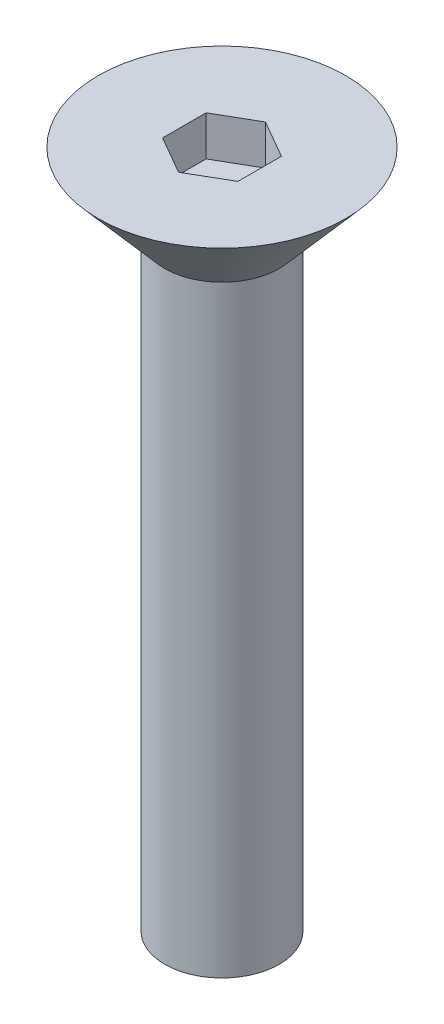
ISO-10303-21;
HEADER;
FILE_DESCRIPTION(('STEP AP214'),'2;1');
FILE_NAME('part.step','',(''),(''),'','','');
FILE_SCHEMA(('AUTOMOTIVE_DESIGN { 1 0 10303 214 1 1 1 1 }'));
ENDSEC;
DATA;
#1=APPLICATION_CONTEXT('core data for automotive mechanical design processes');
#2=APPLICATION_PROTOCOL_DEFINITION('international standard','automotive_design',2000,#1);
#3=PRODUCT_CONTEXT('',#1,'mechanical');
#4=PRODUCT('Part','Part','',(#3));
#5=PRODUCT_RELATED_PRODUCT_CATEGORY('part','',(#4));
#6=PRODUCT_DEFINITION_FORMATION('','',#4);
#7=PRODUCT_DEFINITION_CONTEXT('part definition',#1,'design');
#8=PRODUCT_DEFINITION('design','',#6,#7);
#9=PRODUCT_DEFINITION_SHAPE('','',#8);
#10=(LENGTH_UNIT() NAMED_UNIT(*) SI_UNIT(.MILLI.,.METRE.));
#11=(NAMED_UNIT(*) PLANE_ANGLE_UNIT() SI_UNIT($,.RADIAN.));
#12=(NAMED_UNIT(*) SI_UNIT($,.STERADIAN.) SOLID_ANGLE_UNIT());
#13=UNCERTAINTY_MEASURE_WITH_UNIT(LENGTH_MEASURE(1.E-05),#10,'distance_accuracy_value','');
#14=(GEOMETRIC_REPRESENTATION_CONTEXT(3) GLOBAL_UNCERTAINTY_ASSIGNED_CONTEXT((#13)) GLOBAL_UNIT_ASSIGNED_CONTEXT((#10,
#11,#12)) REPRESENTATION_CONTEXT('',''));
#15=CARTESIAN_POINT('',(0.,0.,0.));
#16=DIRECTION('',(0.,0.,1.));
#17=DIRECTION('',(1.,0.,0.));
#18=AXIS2_PLACEMENT_3D('',#15,#16,#17);
#19=CARTESIAN_POINT('',(2.41300000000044,-28.6287390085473,4.44089209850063E-13));
#20=DIRECTION('',(0.,-1.,0.));
#21=DIRECTION('',(0.,0.,-1.));
#22=AXIS2_PLACEMENT_3D('',#19,#20,#21);
#23=PLANE('',#22);
#24=CARTESIAN_POINT('',(8.88178419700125E-13,-28.6287390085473,2.22044604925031E-13));
#25=DIRECTION('',(0.,1.,0.));
#26=DIRECTION('',(0.,0.,1.));
#27=AXIS2_PLACEMENT_3D('',#24,#25,#26);
#28=CIRCLE('',#27,2.41300000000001);
#29=CARTESIAN_POINT('',(8.88312368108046E-13,-28.6287390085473,2.41300000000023));
#30=VERTEX_POINT('',#29);
#31=EDGE_CURVE('E11',#30,#30,#28,.T.);
#32=ORIENTED_EDGE('',*,*,#31,.F.);
#33=EDGE_LOOP('',(#32));
#34=FACE_BOUND('',#33,.T.);
#35=ADVANCED_FACE('F30',(#34),#23,.T.);
#36=CARTESIAN_POINT('',(2.22044604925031E-13,25.4,4.44089209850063E-13));
#37=DIRECTION('',(0.,1.,0.));
#38=DIRECTION('',(0.,0.,1.));
#39=AXIS2_PLACEMENT_3D('',#36,#37,#38);
#40=CYLINDRICAL_SURFACE('',#39,2.413);
#41=ORIENTED_EDGE('',*,*,#31,.T.);
#42=EDGE_LOOP('',(#41));
#43=FACE_BOUND('',#42,.T.);
#44=CARTESIAN_POINT('',(4.44089209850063E-13,-3.22873900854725,0.));
#45=DIRECTION('',(0.,1.,0.));
#46=DIRECTION('',(0.,0.,1.));
#47=AXIS2_PLACEMENT_3D('',#44,#45,#46);
#48=CIRCLE('',#47,2.413);
#49=CARTESIAN_POINT('',(4.44223158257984E-13,-3.22873900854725,2.413));
#50=VERTEX_POINT('',#49);
#51=EDGE_CURVE('E37',#50,#50,#48,.T.);
#52=ORIENTED_EDGE('',*,*,#51,.F.);
#53=EDGE_LOOP('',(#52));
#54=FACE_BOUND('',#53,.T.);
#55=ADVANCED_FACE('F143',(#43,#54),#40,.T.);
#56=CARTESIAN_POINT('',(4.44089209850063E-13,-3.22873900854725,0.));
#57=DIRECTION('',(0.,1.,0.));
#58=DIRECTION('',(0.,0.,1.));
#59=AXIS2_PLACEMENT_3D('',#56,#57,#58);
#60=CONICAL_SURFACE('',#59,2.413,0.715584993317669);
#61=CARTESIAN_POINT('',(0.,0.,0.));
#62=DIRECTION('',(0.,1.,0.));
#63=DIRECTION('',(0.,0.,1.));
#64=AXIS2_PLACEMENT_3D('',#61,#62,#63);
#65=CIRCLE('',#64,5.2197);
#66=CARTESIAN_POINT('',(0.,0.,5.2197));
#67=VERTEX_POINT('',#66);
#68=EDGE_CURVE('E130',#67,#67,#65,.T.);
#69=ORIENTED_EDGE('',*,*,#68,.F.);
#70=EDGE_LOOP('',(#69));
#71=FACE_BOUND('',#70,.T.);
#72=ORIENTED_EDGE('',*,*,#51,.T.);
#73=EDGE_LOOP('',(#72));
#74=FACE_BOUND('',#73,.T.);
#75=ADVANCED_FACE('F141',(#71,#74),#60,.T.);
#76=CARTESIAN_POINT('',(0.,0.,0.));
#77=DIRECTION('',(0.,1.,0.));
#78=DIRECTION('',(0.,0.,1.));
#79=AXIS2_PLACEMENT_3D('',#76,#77,#78);
#80=PLANE('',#79);
#81=DIRECTION('',(0.,0.,1.));
#82=VECTOR('',#81,1.);
#83=CARTESIAN_POINT('',(-1.58749999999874,0.,-0.916543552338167));
#84=LINE('',#83,#82);
#85=CARTESIAN_POINT('',(-1.58749999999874,0.,-0.916543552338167));
#86=VERTEX_POINT('',#85);
#87=CARTESIAN_POINT('',(-1.58749999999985,0.,0.916543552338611));
#88=VERTEX_POINT('',#87);
#89=EDGE_CURVE('E44',#86,#88,#84,.T.);
#90=ORIENTED_EDGE('',*,*,#89,.F.);
#91=DIRECTION('',(-0.866025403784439,0.,0.5));
#92=VECTOR('',#91,1.);
#93=CARTESIAN_POINT('',(6.66133814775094E-13,0.,-1.83308710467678));
#94=LINE('',#93,#92);
#95=CARTESIAN_POINT('',(6.66133814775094E-13,0.,-1.83308710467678));
#96=VERTEX_POINT('',#95);
#97=EDGE_CURVE('E114',#96,#86,#94,.T.);
#98=ORIENTED_EDGE('',*,*,#97,.F.);
#99=DIRECTION('',(0.866025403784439,0.,0.5));
#100=VECTOR('',#99,1.);
#101=CARTESIAN_POINT('',(6.66133814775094E-13,0.,-1.83308710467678));
#102=LINE('',#101,#100);
#103=CARTESIAN_POINT('',(1.58750000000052,0.,-0.916543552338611));
#104=VERTEX_POINT('',#103);
#105=EDGE_CURVE('E109',#96,#104,#102,.T.);
#106=ORIENTED_EDGE('',*,*,#105,.T.);
#107=DIRECTION('',(0.,0.,1.));
#108=VECTOR('',#107,1.);
#109=CARTESIAN_POINT('',(1.58750000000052,0.,-0.916543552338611));
#110=LINE('',#109,#108);
#111=CARTESIAN_POINT('',(1.58750000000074,0.,0.916543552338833));
#112=VERTEX_POINT('',#111);
#113=EDGE_CURVE('E107',#104,#112,#110,.T.);
#114=ORIENTED_EDGE('',*,*,#113,.T.);
#115=DIRECTION('',(0.866025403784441,0.,-0.499999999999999));
#116=VECTOR('',#115,1.);
#117=CARTESIAN_POINT('',(6.66133814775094E-13,0.,1.83308710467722));
#118=LINE('',#117,#116);
#119=CARTESIAN_POINT('',(6.66133814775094E-13,0.,1.83308710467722));
#120=VERTEX_POINT('',#119);
#121=EDGE_CURVE('E89',#120,#112,#118,.T.);
#122=ORIENTED_EDGE('',*,*,#121,.F.);
#123=DIRECTION('',(-0.866025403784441,0.,-0.499999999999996));
#124=VECTOR('',#123,1.);
#125=CARTESIAN_POINT('',(6.66133814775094E-13,0.,1.83308710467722));
#126=LINE('',#125,#124);
#127=EDGE_CURVE('E99',#120,#88,#126,.T.);
#128=ORIENTED_EDGE('',*,*,#127,.T.);
#129=EDGE_LOOP('',(#90,#98,#106,#114,#122,#128));
#130=FACE_BOUND('',#129,.T.);
#131=ORIENTED_EDGE('',*,*,#68,.T.);
#132=EDGE_LOOP('',(#131));
#133=FACE_BOUND('',#132,.T.);
#134=ADVANCED_FACE('F103',(#130,#133),#80,.T.);
#135=CARTESIAN_POINT('',(-1.58749999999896,-1.68402000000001,-0.916543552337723));
#136=DIRECTION('',(-1.,0.,0.));
#137=DIRECTION('',(0.,0.,1.));
#138=AXIS2_PLACEMENT_3D('',#135,#136,#137);
#139=PLANE('',#138);
#140=ORIENTED_EDGE('',*,*,#89,.T.);
#141=DIRECTION('',(0.,1.,0.));
#142=VECTOR('',#141,1.);
#143=CARTESIAN_POINT('',(-1.58749999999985,-1.68401999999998,0.916543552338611));
#144=LINE('',#143,#142);
#145=CARTESIAN_POINT('',(-1.58749999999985,-1.68401999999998,0.916543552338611));
#146=VERTEX_POINT('',#145);
#147=EDGE_CURVE('E96',#146,#88,#144,.T.);
#148=ORIENTED_EDGE('',*,*,#147,.F.);
#149=DIRECTION('',(0.,0.,1.));
#150=VECTOR('',#149,1.);
#151=CARTESIAN_POINT('',(-1.58749999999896,-1.68402000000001,-0.916543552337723));
#152=LINE('',#151,#150);
#153=CARTESIAN_POINT('',(-1.58749999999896,-1.68402000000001,-0.916543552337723));
#154=VERTEX_POINT('',#153);
#155=EDGE_CURVE('E116',#154,#146,#152,.T.);
#156=ORIENTED_EDGE('',*,*,#155,.F.);
#157=DIRECTION('',(0.,1.,0.));
#158=VECTOR('',#157,1.);
#159=CARTESIAN_POINT('',(-1.58749999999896,-1.68402000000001,-0.916543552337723));
#160=LINE('',#159,#158);
#161=EDGE_CURVE('E51',#154,#86,#160,.T.);
#162=ORIENTED_EDGE('',*,*,#161,.T.);
#163=EDGE_LOOP('',(#140,#148,#156,#162));
#164=FACE_BOUND('',#163,.T.);
#165=ADVANCED_FACE('F156',(#164),#139,.F.);
#166=CARTESIAN_POINT('',(4.44089209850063E-13,-1.68402000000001,-1.833087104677));
#167=DIRECTION('',(-0.5,0.,-0.866025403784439));
#168=DIRECTION('',(-0.866025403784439,0.,0.5));
#169=AXIS2_PLACEMENT_3D('',#166,#167,#168);
#170=PLANE('',#169);
#171=ORIENTED_EDGE('',*,*,#97,.T.);
#172=ORIENTED_EDGE('',*,*,#161,.F.);
#173=DIRECTION('',(-0.866025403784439,0.,0.5));
#174=VECTOR('',#173,1.);
#175=CARTESIAN_POINT('',(4.44089209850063E-13,-1.68402000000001,-1.833087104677));
#176=LINE('',#175,#174);
#177=CARTESIAN_POINT('',(4.44089209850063E-13,-1.68402000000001,-1.833087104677));
#178=VERTEX_POINT('',#177);
#179=EDGE_CURVE('E126',#178,#154,#176,.T.);
#180=ORIENTED_EDGE('',*,*,#179,.F.);
#181=DIRECTION('',(0.,1.,0.));
#182=VECTOR('',#181,1.);
#183=CARTESIAN_POINT('',(4.44089209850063E-13,-1.68402000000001,-1.833087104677));
#184=LINE('',#183,#182);
#185=EDGE_CURVE('E131',#178,#96,#184,.T.);
#186=ORIENTED_EDGE('',*,*,#185,.T.);
#187=EDGE_LOOP('',(#171,#172,#180,#186));
#188=FACE_BOUND('',#187,.T.);
#189=ADVANCED_FACE('F159',(#188),#170,.F.);
#190=CARTESIAN_POINT('',(4.44089209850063E-13,-1.68402000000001,-1.833087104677));
#191=DIRECTION('',(-0.5,0.,0.866025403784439));
#192=DIRECTION('',(0.866025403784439,0.,0.5));
#193=AXIS2_PLACEMENT_3D('',#190,#191,#192);
#194=PLANE('',#193);
#195=ORIENTED_EDGE('',*,*,#105,.F.);
#196=ORIENTED_EDGE('',*,*,#185,.F.);
#197=DIRECTION('',(0.866025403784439,0.,0.5));
#198=VECTOR('',#197,1.);
#199=CARTESIAN_POINT('',(4.44089209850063E-13,-1.68402000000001,-1.833087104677));
#200=LINE('',#199,#198);
#201=CARTESIAN_POINT('',(1.58750000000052,-1.68402000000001,-0.916543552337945));
#202=VERTEX_POINT('',#201);
#203=EDGE_CURVE('E124',#178,#202,#200,.T.);
#204=ORIENTED_EDGE('',*,*,#203,.T.);
#205=DIRECTION('',(0.,1.,0.));
#206=VECTOR('',#205,1.);
#207=CARTESIAN_POINT('',(1.58750000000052,-1.68402000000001,-0.916543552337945));
#208=LINE('',#207,#206);
#209=EDGE_CURVE('E133',#202,#104,#208,.T.);
#210=ORIENTED_EDGE('',*,*,#209,.T.);
#211=EDGE_LOOP('',(#195,#196,#204,#210));
#212=FACE_BOUND('',#211,.T.);
#213=ADVANCED_FACE('F168',(#212),#194,.T.);
#214=CARTESIAN_POINT('',(1.58750000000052,-1.68402000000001,-0.916543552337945));
#215=DIRECTION('',(-1.,0.,0.));
#216=DIRECTION('',(0.,0.,1.));
#217=AXIS2_PLACEMENT_3D('',#214,#215,#216);
#218=PLANE('',#217);
#219=ORIENTED_EDGE('',*,*,#113,.F.);
#220=ORIENTED_EDGE('',*,*,#209,.F.);
#221=DIRECTION('',(0.,0.,1.));
#222=VECTOR('',#221,1.);
#223=CARTESIAN_POINT('',(1.58750000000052,-1.68402000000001,-0.916543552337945));
#224=LINE('',#223,#222);
#225=CARTESIAN_POINT('',(1.58750000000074,-1.68402000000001,0.916543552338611));
#226=VERTEX_POINT('',#225);
#227=EDGE_CURVE('E122',#202,#226,#224,.T.);
#228=ORIENTED_EDGE('',*,*,#227,.T.);
#229=DIRECTION('',(0.,1.,0.));
#230=VECTOR('',#229,1.);
#231=CARTESIAN_POINT('',(1.58750000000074,-1.68402000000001,0.916543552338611));
#232=LINE('',#231,#230);
#233=EDGE_CURVE('E95',#226,#112,#232,.T.);
#234=ORIENTED_EDGE('',*,*,#233,.T.);
#235=EDGE_LOOP('',(#219,#220,#228,#234));
#236=FACE_BOUND('',#235,.T.);
#237=ADVANCED_FACE('F165',(#236),#218,.T.);
#238=CARTESIAN_POINT('',(6.66133814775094E-13,-1.68401999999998,1.83308710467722));
#239=DIRECTION('',(0.499999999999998,0.,0.86602540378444));
#240=DIRECTION('',(0.866025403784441,0.,-0.499999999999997));
#241=AXIS2_PLACEMENT_3D('',#238,#239,#240);
#242=PLANE('',#241);
#243=ORIENTED_EDGE('',*,*,#121,.T.);
#244=ORIENTED_EDGE('',*,*,#233,.F.);
#245=DIRECTION('',(0.866025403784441,0.,-0.499999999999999));
#246=VECTOR('',#245,1.);
#247=CARTESIAN_POINT('',(6.66133814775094E-13,-1.68401999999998,1.83308710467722));
#248=LINE('',#247,#246);
#249=CARTESIAN_POINT('',(6.66133814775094E-13,-1.68401999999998,1.83308710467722));
#250=VERTEX_POINT('',#249);
#251=EDGE_CURVE('E92',#250,#226,#248,.T.);
#252=ORIENTED_EDGE('',*,*,#251,.F.);
#253=DIRECTION('',(0.,1.,0.));
#254=VECTOR('',#253,1.);
#255=CARTESIAN_POINT('',(6.66133814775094E-13,-1.68401999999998,1.83308710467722));
#256=LINE('',#255,#254);
#257=EDGE_CURVE('E84',#250,#120,#256,.T.);
#258=ORIENTED_EDGE('',*,*,#257,.T.);
#259=EDGE_LOOP('',(#243,#244,#252,#258));
#260=FACE_BOUND('',#259,.T.);
#261=ADVANCED_FACE('F86',(#260),#242,.F.);
#262=CARTESIAN_POINT('',(6.66133814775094E-13,-1.68401999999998,1.83308710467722));
#263=DIRECTION('',(0.499999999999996,0.,-0.866025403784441));
#264=DIRECTION('',(-0.866025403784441,0.,-0.499999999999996));
#265=AXIS2_PLACEMENT_3D('',#262,#263,#264);
#266=PLANE('',#265);
#267=ORIENTED_EDGE('',*,*,#127,.F.);
#268=ORIENTED_EDGE('',*,*,#257,.F.);
#269=DIRECTION('',(-0.866025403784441,0.,-0.499999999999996));
#270=VECTOR('',#269,1.);
#271=CARTESIAN_POINT('',(6.66133814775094E-13,-1.68401999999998,1.83308710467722));
#272=LINE('',#271,#270);
#273=EDGE_CURVE('E119',#250,#146,#272,.T.);
#274=ORIENTED_EDGE('',*,*,#273,.T.);
#275=ORIENTED_EDGE('',*,*,#147,.T.);
#276=EDGE_LOOP('',(#267,#268,#274,#275));
#277=FACE_BOUND('',#276,.T.);
#278=ADVANCED_FACE('F100',(#277),#266,.T.);
#279=CARTESIAN_POINT('',(-1.58749999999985,-1.68401999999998,0.916543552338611));
#280=DIRECTION('',(0.,-1.,0.));
#281=DIRECTION('',(0.,0.,-1.));
#282=AXIS2_PLACEMENT_3D('',#279,#280,#281);
#283=PLANE('',#282);
#284=ORIENTED_EDGE('',*,*,#155,.T.);
#285=ORIENTED_EDGE('',*,*,#273,.F.);
#286=ORIENTED_EDGE('',*,*,#251,.T.);
#287=ORIENTED_EDGE('',*,*,#227,.F.);
#288=ORIENTED_EDGE('',*,*,#203,.F.);
#289=ORIENTED_EDGE('',*,*,#179,.T.);
#290=EDGE_LOOP('',(#284,#285,#286,#287,#288,#289));
#291=FACE_BOUND('',#290,.T.);
#292=ADVANCED_FACE('F162',(#291),#283,.F.);
#293=CLOSED_SHELL('',(#35,#55,#75,#134,#165,#189,#213,#237,#261,#278,#292));
#294=MANIFOLD_SOLID_BREP('B2',#293);
#295=ADVANCED_BREP_SHAPE_REPRESENTATION('',(#18,#294),#14);
#296=SHAPE_DEFINITION_REPRESENTATION(#9,#295);
ENDSEC;
END-ISO-10303-21;
